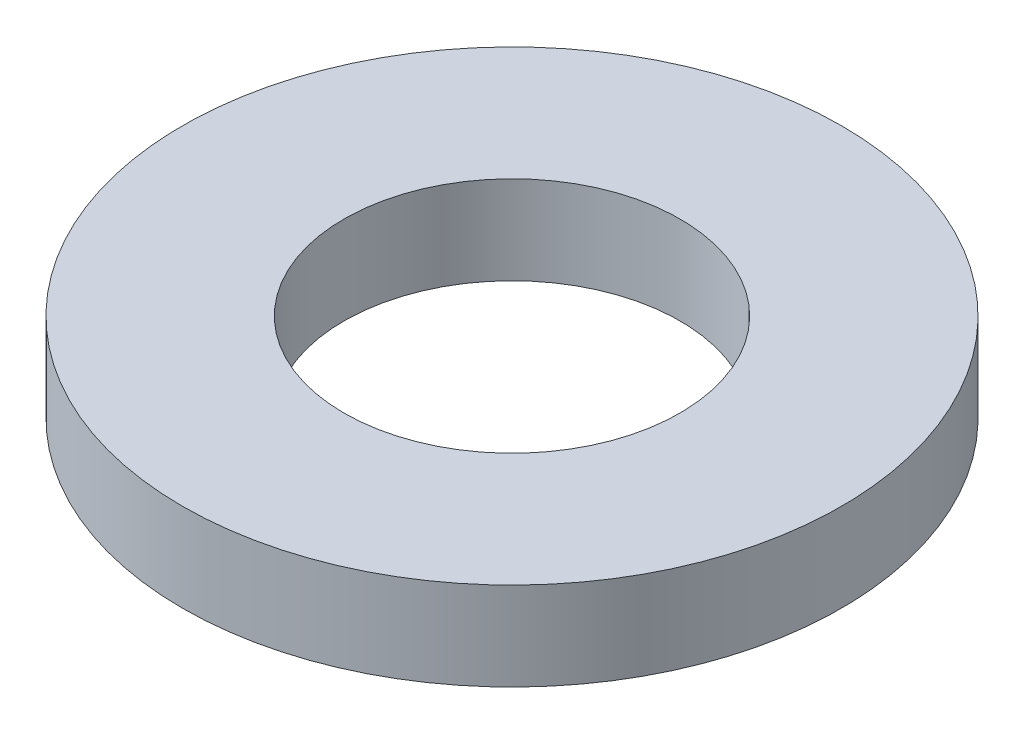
from build123d import *

# Parameters (mm, degrees)
SKETCH1_R           = 6.35
BOSS_EXTRUDE1_DEPTH = 1.7018
SKETCH5_R           = 3.2385
CUT_EXTRUDE1_DEPTH  = 10.140083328


with BuildPart() as part:
    # Sketch1 → Boss-Extrude1 (new body)
    with BuildSketch(Plane(origin=(0, 0, 0), x_dir=(1, 0, 0), z_dir=(0, 1, 0))):
        with Locations(Location((0, 0, 0), (0, 0, 270))):
            Circle(SKETCH1_R)
    extrude(amount=BOSS_EXTRUDE1_DEPTH)

    # Sketch5 → Cut-Extrude1 (cut, through all)
    with BuildSketch(Plane(origin=(0, 1.7018, 0), x_dir=(-1, 0, 0), z_dir=(0, 1, 0))):
        with Locations(Location((0, 0, 0), (0, 0, 90))):
            Circle(SKETCH5_R)
    extrude(amount=-CUT_EXTRUDE1_DEPTH, mode=Mode.SUBTRACT)


solid = part.part
